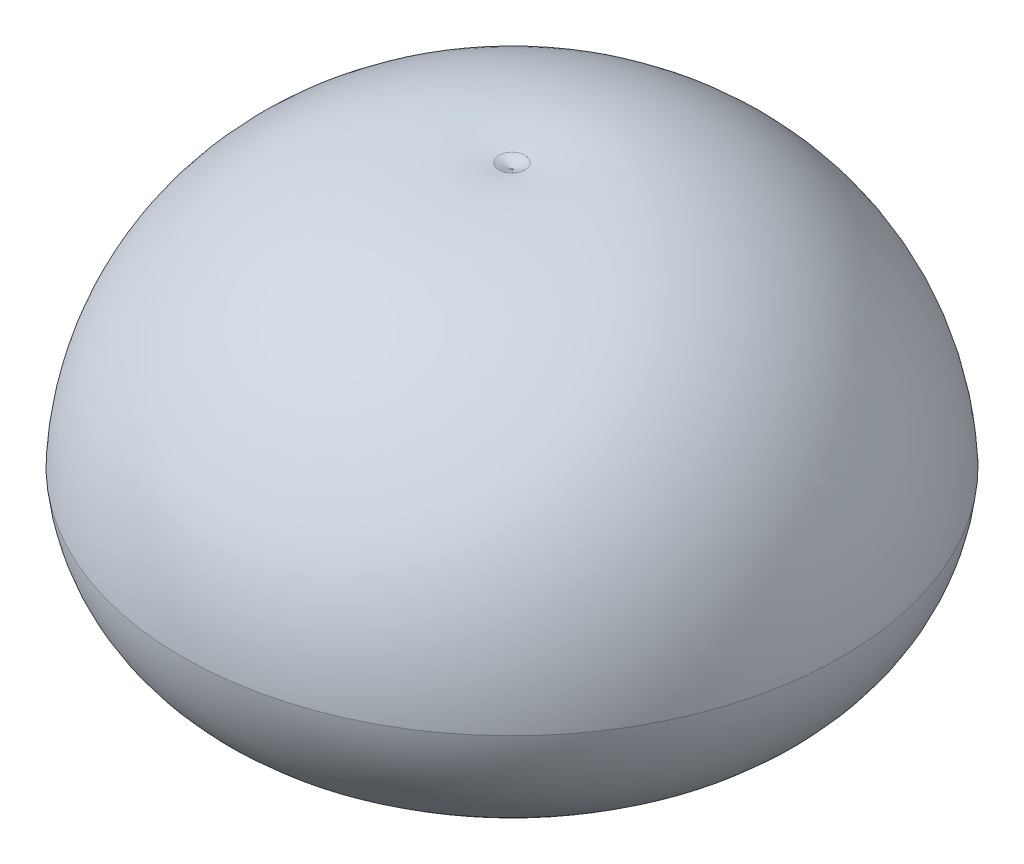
ISO-10303-21;
HEADER;
FILE_DESCRIPTION(('STEP AP214'),'2;1');
FILE_NAME('part.step','',(''),(''),'','','');
FILE_SCHEMA(('AUTOMOTIVE_DESIGN { 1 0 10303 214 1 1 1 1 }'));
ENDSEC;
DATA;
#1=APPLICATION_CONTEXT('core data for automotive mechanical design processes');
#2=APPLICATION_PROTOCOL_DEFINITION('international standard','automotive_design',2000,#1);
#3=PRODUCT_CONTEXT('',#1,'mechanical');
#4=PRODUCT('Part','Part','',(#3));
#5=PRODUCT_RELATED_PRODUCT_CATEGORY('part','',(#4));
#6=PRODUCT_DEFINITION_FORMATION('','',#4);
#7=PRODUCT_DEFINITION_CONTEXT('part definition',#1,'design');
#8=PRODUCT_DEFINITION('design','',#6,#7);
#9=PRODUCT_DEFINITION_SHAPE('','',#8);
#10=(LENGTH_UNIT() NAMED_UNIT(*) SI_UNIT(.MILLI.,.METRE.));
#11=(NAMED_UNIT(*) PLANE_ANGLE_UNIT() SI_UNIT($,.RADIAN.));
#12=(NAMED_UNIT(*) SI_UNIT($,.STERADIAN.) SOLID_ANGLE_UNIT());
#13=UNCERTAINTY_MEASURE_WITH_UNIT(LENGTH_MEASURE(1.E-05),#10,'distance_accuracy_value','');
#14=(GEOMETRIC_REPRESENTATION_CONTEXT(3) GLOBAL_UNCERTAINTY_ASSIGNED_CONTEXT((#13)) GLOBAL_UNIT_ASSIGNED_CONTEXT((#10,
#11,#12)) REPRESENTATION_CONTEXT('',''));
#15=CARTESIAN_POINT('',(0.,0.,0.));
#16=DIRECTION('',(0.,0.,1.));
#17=DIRECTION('',(1.,0.,0.));
#18=AXIS2_PLACEMENT_3D('',#15,#16,#17);
#19=CARTESIAN_POINT('',(0.,1411.75999735,0.));
#20=DIRECTION('',(0.,-1.,0.));
#21=DIRECTION('',(0.,0.,-1.));
#22=AXIS2_PLACEMENT_3D('',#19,#20,#21);
#23=DEGENERATE_TOROIDAL_SURFACE('',#22,1474.22211761,1530.55545473,.T.);
#24=CARTESIAN_POINT('',(0.,94.3359858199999,0.));
#25=DIRECTION('',(0.,-1.,0.));
#26=DIRECTION('',(0.,0.,-1.));
#27=AXIS2_PLACEMENT_3D('',#24,#25,#26);
#28=CIRCLE('',#27,695.123937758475);
#29=CARTESIAN_POINT('',(0.,94.3359858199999,-695.123937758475));
#30=VERTEX_POINT('',#29);
#31=EDGE_CURVE('E9',#30,#30,#28,.T.);
#32=ORIENTED_EDGE('',*,*,#31,.F.);
#33=EDGE_LOOP('',(#32));
#34=FACE_BOUND('',#33,.T.);
#35=CARTESIAN_POINT('',(0.,1262.42469580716,0.));
#36=DIRECTION('',(0.,-1.,0.));
#37=DIRECTION('',(0.,0.,-1.));
#38=AXIS2_PLACEMENT_3D('',#35,#36,#37);
#39=CIRCLE('',#38,2997.47487658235);
#40=CARTESIAN_POINT('',(0.,1262.42469580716,-2997.47487658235));
#41=VERTEX_POINT('',#40);
#42=EDGE_CURVE('E41',#41,#41,#39,.T.);
#43=ORIENTED_EDGE('',*,*,#42,.T.);
#44=EDGE_LOOP('',(#43));
#45=FACE_BOUND('',#44,.T.);
#46=ADVANCED_FACE('F14',(#34,#45),#23,.T.);
#47=CARTESIAN_POINT('',(0.,94.3359858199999,0.));
#48=DIRECTION('',(0.,-1.,0.));
#49=DIRECTION('',(0.,0.,-1.));
#50=AXIS2_PLACEMENT_3D('',#47,#48,#49);
#51=CONICAL_SURFACE('',#50,695.123937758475,0.357792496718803);
#52=CARTESIAN_POINT('',(0.,282.86569259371,0.));
#53=DIRECTION('',(0.,-1.,0.));
#54=DIRECTION('',(0.,0.,-1.));
#55=AXIS2_PLACEMENT_3D('',#52,#53,#54);
#56=CIRCLE('',#55,624.635568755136);
#57=CARTESIAN_POINT('',(0.,282.86569259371,-624.635568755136));
#58=VERTEX_POINT('',#57);
#59=EDGE_CURVE('E21',#58,#58,#56,.T.);
#60=ORIENTED_EDGE('',*,*,#59,.F.);
#61=EDGE_LOOP('',(#60));
#62=FACE_BOUND('',#61,.T.);
#63=ORIENTED_EDGE('',*,*,#31,.T.);
#64=EDGE_LOOP('',(#63));
#65=FACE_BOUND('',#64,.T.);
#66=ADVANCED_FACE('F61',(#62,#65),#51,.F.);
#67=CARTESIAN_POINT('',(0.,1140.,0.));
#68=DIRECTION('',(0.,-1.,0.));
#69=DIRECTION('',(0.,0.,-1.));
#70=AXIS2_PLACEMENT_3D('',#67,#68,#69);
#71=DEGENERATE_TOROIDAL_SURFACE('',#70,460.,872.80243551,.T.);
#72=CARTESIAN_POINT('',(0.,1755.79249430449,0.));
#73=DIRECTION('',(0.,-1.,0.));
#74=DIRECTION('',(0.,0.,-1.));
#75=AXIS2_PLACEMENT_3D('',#72,#73,#74);
#76=CIRCLE('',#75,1078.53350385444);
#77=CARTESIAN_POINT('',(0.,1755.79249430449,-1078.53350385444));
#78=VERTEX_POINT('',#77);
#79=EDGE_CURVE('E35',#78,#78,#76,.T.);
#80=ORIENTED_EDGE('',*,*,#79,.F.);
#81=EDGE_LOOP('',(#80));
#82=FACE_BOUND('',#81,.T.);
#83=ORIENTED_EDGE('',*,*,#59,.T.);
#84=EDGE_LOOP('',(#83));
#85=FACE_BOUND('',#84,.T.);
#86=ADVANCED_FACE('F31',(#82,#85),#71,.F.);
#87=CARTESIAN_POINT('',(0.,1665.,449.32667397));
#88=DIRECTION('',(-1.,0.,0.));
#89=DIRECTION('',(0.,0.,-1.));
#90=AXIS2_PLACEMENT_3D('',#87,#88,#89);
#91=CIRCLE('',#90,1530.55545473);
#92=TRIMMED_CURVE('',#91,(PARAMETER_VALUE(-1.27283603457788)),
(PARAMETER_VALUE(1.27283603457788)),.T.,.PARAMETER.);
#93=CARTESIAN_POINT('',(0.,1665.,0.));
#94=DIRECTION('',(0.,-1.,0.));
#95=AXIS1_PLACEMENT('',#93,#94);
#96=SURFACE_OF_REVOLUTION('',#92,#95);
#97=CARTESIAN_POINT('',(0.,3128.11501258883,0.));
#98=VERTEX_POINT('',#97);
#99=VERTEX_LOOP('',#98);
#100=FACE_BOUND('',#99,.T.);
#101=ORIENTED_EDGE('',*,*,#79,.T.);
#102=EDGE_LOOP('',(#101));
#103=FACE_BOUND('',#102,.T.);
#104=ADVANCED_FACE('F27',(#100,#103),#96,.F.);
#105=CARTESIAN_POINT('',(0.,2670.47175147,-476.00681003));
#106=DIRECTION('',(-1.,0.,0.));
#107=DIRECTION('',(0.,0.,-1.));
#108=AXIS2_PLACEMENT_3D('',#105,#106,#107);
#109=CIRCLE('',#108,1050.);
#110=TRIMMED_CURVE('',#109,(PARAMETER_VALUE(-2.0413050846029)),
(PARAMETER_VALUE(2.0413050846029)),.T.,.PARAMETER.);
#111=CARTESIAN_POINT('',(0.,2670.47175147,0.));
#112=DIRECTION('',(0.,-1.,0.));
#113=AXIS1_PLACEMENT('',#111,#112);
#114=SURFACE_OF_REVOLUTION('',#110,#113);
#115=CARTESIAN_POINT('',(0.,3657.14900329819,0.));
#116=DIRECTION('',(0.,-1.,0.));
#117=DIRECTION('',(0.,0.,-1.));
#118=AXIS2_PLACEMENT_3D('',#115,#116,#117);
#119=CIRCLE('',#118,116.885659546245);
#120=CARTESIAN_POINT('',(0.,3657.14900329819,-116.885659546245));
#121=VERTEX_POINT('',#120);
#122=EDGE_CURVE('E37',#121,#121,#119,.T.);
#123=ORIENTED_EDGE('',*,*,#122,.F.);
#124=EDGE_LOOP('',(#123));
#125=FACE_BOUND('',#124,.T.);
#126=CARTESIAN_POINT('',(-1.66533453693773E-13,3606.37640302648,0.));
#127=VERTEX_POINT('',#126);
#128=VERTEX_LOOP('',#127);
#129=FACE_BOUND('',#128,.T.);
#130=ADVANCED_FACE('F30',(#125,#129),#114,.T.);
#131=CARTESIAN_POINT('',(0.,1140.,0.));
#132=DIRECTION('',(0.,-1.,0.));
#133=DIRECTION('',(0.,0.,-1.));
#134=AXIS2_PLACEMENT_3D('',#131,#132,#133);
#135=DEGENERATE_TOROIDAL_SURFACE('',#134,460.,2540.42645149,.T.);
#136=ORIENTED_EDGE('',*,*,#42,.F.);
#137=EDGE_LOOP('',(#136));
#138=FACE_BOUND('',#137,.T.);
#139=ORIENTED_EDGE('',*,*,#122,.T.);
#140=EDGE_LOOP('',(#139));
#141=FACE_BOUND('',#140,.T.);
#142=ADVANCED_FACE('F48',(#138,#141),#135,.T.);
#143=CLOSED_SHELL('',(#46,#66,#86,#104,#130,#142));
#144=MANIFOLD_SOLID_BREP('B1',#143);
#145=ADVANCED_BREP_SHAPE_REPRESENTATION('',(#18,#144),#14);
#146=SHAPE_DEFINITION_REPRESENTATION(#9,#145);
ENDSEC;
END-ISO-10303-21;
